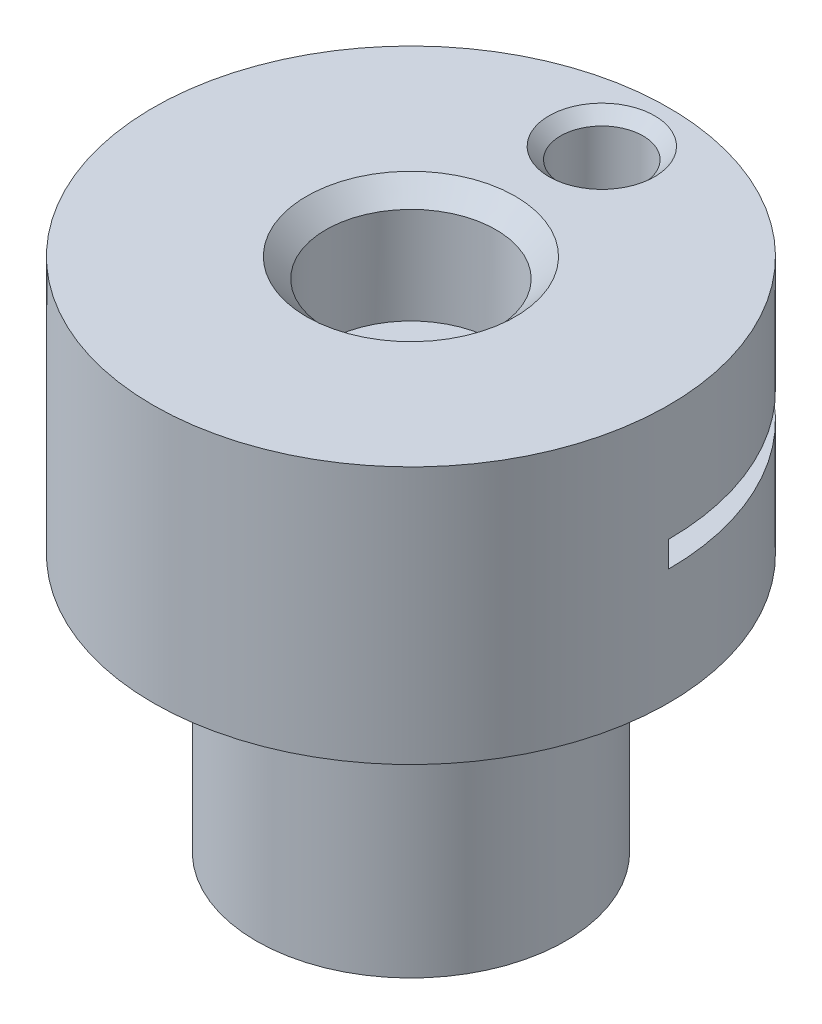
from build123d import *

# Parameters (mm, degrees)
HOLE_WIZARD_M4_1_D           = 3.3
HOLE_WIZARD_M4_1_CSINK_D     = 4.05
HOLE_WIZARD_M4_1_CSINK_ANGLE = 90
HOLE_WIZARD_M2_1_D           = 1.6
HOLE_WIZARD_M2_1_DEPTH       = 5
HOLE_WIZARD_M2_1_CSINK_D     = 2.05
HOLE_WIZARD_M2_1_CSINK_ANGLE = 90
SKETCH_5_W                   = 14.145342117
SKETCH_5_H                   = 0.5
CUT_EXTRUDE_1_DEPTH          = 10


with BuildPart() as part:
    # Sketch 1 → Revolve 1 (revolve)
    with BuildSketch(Plane.XY, mode=Mode.PRIVATE) as revolve_1_sk:
        Polygon((0, 0), (-3, 0), (-3, 5), (-5, 5), (-5, 10), (0, 10), align=None)
    revolve(revolve_1_sk.sketch.rotate(Axis((0, 12.808587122, 0), (0, -1, 0)), 270), axis=Axis((0, 12.808587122, 0), (0, -1, 0)))

    # Hole Wizard M4 _1 (through all)
    with Locations(Plane(origin=(0.000258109, 10, 0.00018471), x_dir=(0, 0, 1), z_dir=(0, 1, 0))):
        with Locations((0, 0)):
            CounterSinkHole(HOLE_WIZARD_M4_1_D / 2, HOLE_WIZARD_M4_1_CSINK_D / 2, counter_sink_angle=HOLE_WIZARD_M4_1_CSINK_ANGLE)

    # Hole Wizard M2 _1
    with Locations(Plane(origin=(0, 10, 0), x_dir=(1, 0, 0), z_dir=(0, 1, 0))):
        with Locations((0.000112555, 3.702597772)):
            CounterSinkHole(HOLE_WIZARD_M2_1_D / 2, HOLE_WIZARD_M2_1_CSINK_D / 2, depth=HOLE_WIZARD_M2_1_DEPTH, counter_sink_angle=HOLE_WIZARD_M2_1_CSINK_ANGLE)

    # Sketch 5 → Cut-Extrude 1 (cut)
    with BuildSketch(Plane.XY):
        with Locations((0.000129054, 7.5)):
            Rectangle(SKETCH_5_W, SKETCH_5_H)
    extrude(amount=-CUT_EXTRUDE_1_DEPTH, mode=Mode.SUBTRACT)


solid = part.part
